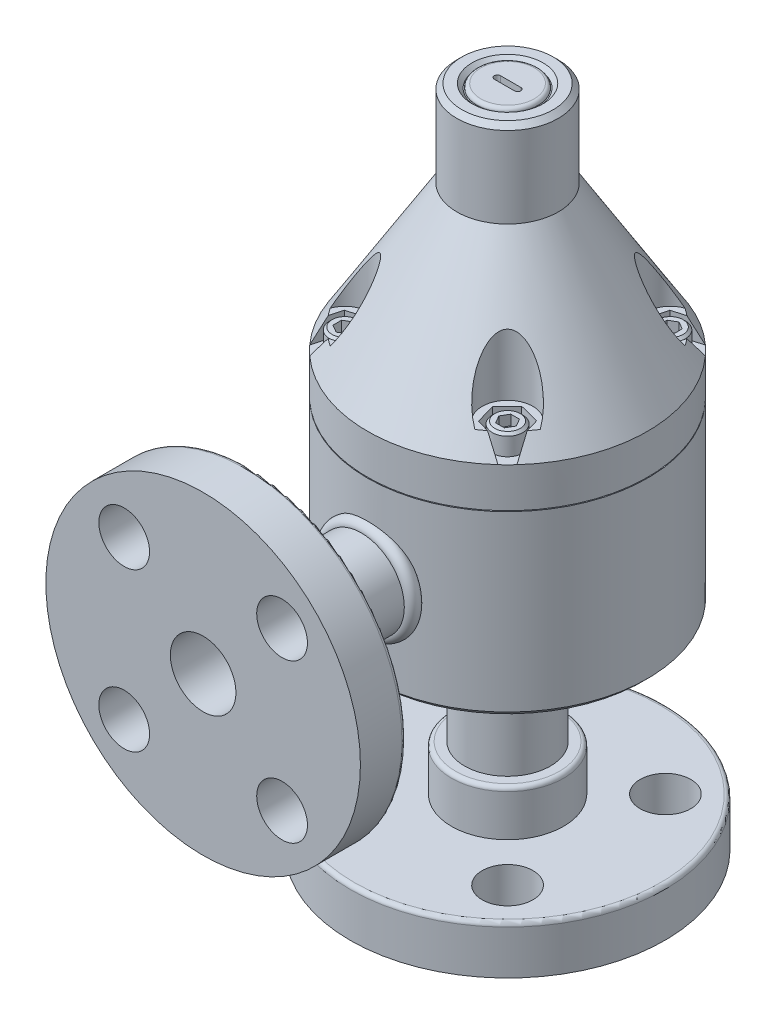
from build123d import *

# Parameters (mm, degrees)
SKETCH1_R                = 43.815
EXTRUDE1_DEPTH           = 140.97
SKETCH3_R                = 11.1125
EXTRUDE2_DEPTH           = 1.27
EXTRUDE2_DRAFT           = -45
CHAMFER1_SIZE            = 1.5748
SKETCH4_R                = 9.525
EXTRUDE3_DEPTH           = 1.27
FILLET1_R                = 1.143
EXTRUDE4_DEPTH           = 3.302
EXTRUDE4_DRAFT           = -1
SKETCH6_R                = 7.9375
EXTRUDE5_DEPTH           = 22.86
EXTRUDE6_DEPTH           = 6.35
CIRPATTERN1_COUNT        = 4
SKETCH9_R                = 4.7625
EXTRUDE7_DEPTH           = 6.35
EXTRUDE8_DEPTH           = 3.175
CIRPATTERN2_COUNT        = 4
CHAMFER2_SIZE            = 0.762
SKETCH11_R               = 49.2125
BOSS_EXTRUDE1_DEPTH      = 14.2748
SKETCH12_R               = 17.4625
BOSS_EXTRUDE2_DEPTH      = 26.2128
BOSS_EXTRUDE3_REACH      = 206.043
BOSS_EXTRUDE3_END_RADIUS = 43.815
SKETCH13_R               = 13.4366
SKETCH14_R               = 10.2616
CUT_EXTRUDE1_DEPTH       = 25.4
SKETCH15_R               = 7.9375
CUT_EXTRUDE2_DEPTH       = 25.4
CIRPATTERN3_COUNT        = 4
SKETCH23_R               = 49.2125
BOSS_EXTRUDE8_DEPTH      = 15.0622
SKETCH24_R               = 17.526
BOSS_EXTRUDE9_DEPTH      = 29.3624
SKETCH25_R               = 13.4366
BOSS_EXTRUDE10_DEPTH     = 66.675
SKETCH26_R               = 10.2616
CUT_EXTRUDE5_DEPTH       = 25.4
FILLET4_R                = 1.27
SKETCH27_R               = 7.9375
CUT_EXTRUDE6_DEPTH       = 25.4
CIRPATTERN5_COUNT        = 4
FILLET5_R                = 1.27


with BuildPart() as part:
    # Sketch1 → Extrude1 (new body)
    with BuildSketch(Plane(origin=(0, 0, 0), x_dir=(1, 0, 0), z_dir=(0, 1, 0))):
        with Locations(Location((0, 0, 0), (0, 0, 270))):
            Circle(SKETCH1_R)
    extrude(amount=EXTRUDE1_DEPTH)

    # Sketch2 → Cut-Revolve1 (revolve, cut)
    with BuildSketch(Plane.XY, mode=Mode.PRIVATE) as cut_revolve1_sk:
        Polygon((-43.815, 56.134), (-43.815, 68.58), (-15.875, 114.046), (-15.875, 147.034008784), (-49.44729897, 147.034008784), (-49.44729897, 55.88), (-30.226, 55.88), (-30.226, 56.134), align=None)
    revolve(cut_revolve1_sk.sketch.rotate(Axis((0, 0, 0), (0, 1, 0)), 270), axis=Axis((0, 0, 0), (0, 1, 0)), mode=Mode.SUBTRACT)


with BuildPart() as extrude2_tool:
    # Sketch3 → Extrude2 (with draft: the straight prism first)
    with BuildSketch(Plane(origin=(0, 140.97, 0), x_dir=(-1, 0, 0), z_dir=(0, 1, 0))):
        Circle(SKETCH3_R)
    extrude(amount=-EXTRUDE2_DEPTH)
    # Extrude2: the draft: its side faces are tilted about the plane it starts from
    extrude2_sides = [extrude2_tool.faces().sort_by_distance(p)[0] for p in [
        (11.1125, 140.335, 0),
    ]]
    draft(extrude2_sides, Plane(origin=(0, 140.97, 0), x_dir=(-1, 0, 0), z_dir=(0, 1, 0)), EXTRUDE2_DRAFT)


with BuildPart() as part_1:
    add(part.part)

    # Extrude2: cut by extrude2_tool
    add(extrude2_tool.part, mode=Mode.SUBTRACT)

    # Chamfer1
    chamfer1_edges = [part_1.edges().sort_by_distance(p)[0] for p in [
        (0, 0, -43.815),
        (0, 140.97, 15.875),
    ]]
    chamfer(chamfer1_edges, length=CHAMFER1_SIZE)

    # Sketch4 → Extrude3 (add)
    with BuildSketch(Plane(origin=(0, 140.97, 0), x_dir=(-1, 0, 0), z_dir=(0, 1, 0))):
        with Locations(Location((0, 0, 0), (0, 0, 90))):
            Circle(SKETCH4_R)
    extrude(amount=-EXTRUDE3_DEPTH)

    # Fillet1
    fillet1_edges = [part_1.edges().sort_by_distance(p)[0] for p in [
        (0, 140.97, -9.525),
    ]]
    fillet(fillet1_edges, radius=FILLET1_R)


with BuildPart() as extrude4_tool:
    # Sketch5 → Extrude4 (with draft: the straight prism first)
    with BuildSketch(Plane(origin=(0, 140.97, 0), x_dir=(-1, 0, 0), z_dir=(0, 1, 0))):
        with BuildLine():
            Line((3.175, 0.9652), (-3.175, 0.9652))
            ThreePointArc((-3.175, 0.9652), (-4.1402, 0), (-3.175, -0.9652))
            Line((-3.175, -0.9652), (3.175, -0.9652))
            ThreePointArc((3.175, -0.9652), (4.1402, 0), (3.175, 0.9652))
        make_face()
    extrude(amount=-EXTRUDE4_DEPTH)
    # Extrude4: the draft: its side faces are tilted about the plane it starts from
    extrude4_sides = [extrude4_tool.faces().sort_by_distance(p)[0] for p in [
        (-4.1402, 139.319, 0),
        (0, 139.319, 0.9652),
        (4.1402, 139.319, 0),
        (0, 139.319, -0.9652),
    ]]
    draft(extrude4_sides, Plane(origin=(0, 140.97, 0), x_dir=(-1, 0, 0), z_dir=(0, 1, 0)), EXTRUDE4_DRAFT)


with BuildPart() as part_2:
    add(part_1.part)

    # Extrude4: cut by extrude4_tool
    add(extrude4_tool.part, mode=Mode.SUBTRACT)

    # Sketch6 → Extrude5 (cut)
    with BuildSketch(Plane(origin=(0, 74.93, 0), x_dir=(-1, 0, 0), z_dir=(0, 1, 0))):
        with Locations((-25.459026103, 25.459026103)):
            Circle(SKETCH6_R)
    extrude5 = extrude(amount=EXTRUDE5_DEPTH, mode=Mode.SUBTRACT)

    # Sketch8 → Extrude6 (cut)
    with BuildSketch(Plane(origin=(0, 74.93, 0), x_dir=(-1, 0, 0), z_dir=(0, 1, 0))):
        Polygon((-29.948607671, 20.824591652), (-23.690278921, 19.253717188), (-19.200697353, 23.888151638), (-20.969444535, 30.093460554), (-33.591654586, 33.591654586), align=None)
    extrude6 = extrude(amount=-EXTRUDE6_DEPTH, mode=Mode.SUBTRACT)

    # CirPattern1: Extrude5, Extrude6 ×4 about axis
    cirpattern1_axis = Axis((0, 0, 0), (0, 1, 0))
    add([extrude5.rotate(cirpattern1_axis, i * 360 / CIRPATTERN1_COUNT) for i in range(1, CIRPATTERN1_COUNT)], mode=Mode.SUBTRACT)
    add([extrude6.rotate(cirpattern1_axis, i * 360 / CIRPATTERN1_COUNT) for i in range(1, CIRPATTERN1_COUNT)], mode=Mode.SUBTRACT)

    # Sketch9 → Extrude7 (add)
    with BuildSketch(Plane(origin=(0, 74.93, 0), x_dir=(-1, 0, 0), z_dir=(0, 1, 0))):
        with Locations(Location((-25.459026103, 25.459026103, 0), (0, 0, 90))):
            Circle(SKETCH9_R)
    extrude7 = extrude(amount=-EXTRUDE7_DEPTH)

    # Sketch10 → Extrude8 (cut)
    with BuildSketch(Plane(origin=(0, 74.93, 0), x_dir=(-1, 0, 0), z_dir=(0, 1, 0))):
        Polygon((-28.187127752, 25.459026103), (-26.823076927, 23.096420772), (-24.094975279, 23.096420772), (-22.730924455, 25.459026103), (-24.094975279, 27.821631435), (-26.823076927, 27.821631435), align=None)
    extrude8 = extrude(amount=-EXTRUDE8_DEPTH, mode=Mode.SUBTRACT)

    # CirPattern2: Extrude7, Extrude8 ×4 about axis
    cirpattern2_axis = Axis((0, 0, 0), (0, 1, 0))
    add([extrude7.rotate(cirpattern2_axis, i * 360 / CIRPATTERN2_COUNT) for i in range(1, CIRPATTERN2_COUNT)])
    add([extrude8.rotate(cirpattern2_axis, i * 360 / CIRPATTERN2_COUNT) for i in range(1, CIRPATTERN2_COUNT)], mode=Mode.SUBTRACT)

    # Chamfer2
    chamfer2_edges = [part_2.edges().sort_by_distance(p)[0] for p in [
        (25.459026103, 74.93, 20.696526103),
        (-20.696526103, 74.93, 25.459026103),
        (-25.459026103, 74.93, -20.696526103),
        (20.696526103, 74.93, -25.459026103),
    ]]
    chamfer(chamfer2_edges, length=CHAMFER2_SIZE)



with BuildPart() as body_2:
    # Sketch11 → Boss-Extrude1 (new body)
    with BuildSketch(Plane.XY.offset(95.25)):
        with Locations((0, 28.575)):
            Circle(SKETCH11_R)
    extrude(amount=-BOSS_EXTRUDE1_DEPTH)

    # Sketch12 → Boss-Extrude2 (add)
    with BuildSketch(Plane.XY.offset(95.25)):
        with Locations((0, 28.575)):
            Circle(SKETCH12_R)
    extrude(amount=-BOSS_EXTRUDE2_DEPTH)


with BuildPart() as part_3:
    add(part_2.part)

    add(body_2.part)  # Boss-Extrude3 merges body 2
    # Boss-Extrude3: up to this cylinder (the profile starts outside it)
    boss_extrude3_end = Plane(origin=(0, 28.575, 0), z_dir=(0, -1, 0)) * Cylinder(BOSS_EXTRUDE3_END_RADIUS, 500.716, mode=Mode.PRIVATE)
    # Sketch13 → Boss-Extrude3 (add, up to the surface)
    with BuildSketch(Plane.XY.offset(95.25), mode=Mode.PRIVATE) as boss_extrude3_sk1:
        with Locations((0, 28.575)):
            Circle(SKETCH13_R)
    boss_extrude3_tool1 = extrude(boss_extrude3_sk1.sketch, amount=-BOSS_EXTRUDE3_REACH, mode=Mode.PRIVATE) - boss_extrude3_end
    add(boss_extrude3_tool1.solids().sort_by_distance((0, 28.575, 95.25))[0])

    # Sketch14 → Cut-Extrude1 (cut)
    with BuildSketch(Plane.XY.offset(95.25)):
        with Locations((0, 28.575)):
            Circle(SKETCH14_R)
    extrude(amount=-CUT_EXTRUDE1_DEPTH, mode=Mode.SUBTRACT)

    # Sketch15 → Cut-Extrude2 (cut)
    with BuildSketch(Plane.XY.offset(95.25)):
        with Locations((-24.695704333, 53.270704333)):
            Circle(SKETCH15_R)
    cut_extrude2 = extrude(amount=-CUT_EXTRUDE2_DEPTH, mode=Mode.SUBTRACT)

    # CirPattern3: Cut-Extrude2 ×4 about axis
    cirpattern3_axis = Axis((0, 28.575, 0), (0, 0, 1))
    for i in range(1, CIRPATTERN3_COUNT):
        add(cut_extrude2.rotate(cirpattern3_axis, i * 360 / CIRPATTERN3_COUNT), mode=Mode.SUBTRACT)

    # Sketch16 → Revolve1 (revolve)
    with BuildSketch(Plane(origin=(0, 0, 0), x_dir=(0, 0, -1), z_dir=(1, 0, 0)), mode=Mode.PRIVATE) as revolve1_sk:
        with BuildLine():
            Line((-41.255708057, 38.10228525), (-45.737066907, 38.10228525))
            Line((-45.737066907, 38.10228525), (-45.737066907, 42.0116))
            ThreePointArc((-45.737066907, 42.0116), (-43.699332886, 44.263475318), (-41.255708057, 42.460145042))
            Line((-41.255708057, 42.460145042), (-41.255708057, 38.10228525))
        make_face()
    revolve(revolve1_sk.sketch.rotate(Axis((0, 28.575, 95.25), (0, 0, -1)), 90), axis=Axis((0, 28.575, 95.25), (0, 0, -1)))

    # Fillet5
    fillet5_edges = [part_3.edges().sort_by_distance(p)[0] for p in [
        (-49.2125, 28.575, 80.9752),
        (-17.4625, 28.575, 69.0372),
    ]]
    fillet(fillet5_edges, radius=FILLET5_R)



with BuildPart() as body_2_2:
    # Sketch23 → Boss-Extrude8 (new body)
    with BuildSketch(Plane(origin=(0, -66.675, 0), x_dir=(1, 0, 0), z_dir=(0, 1, 0))):
        with Locations(Location((0, 0, 0), (0, 0, 270))):
            Circle(SKETCH23_R)
    extrude(amount=BOSS_EXTRUDE8_DEPTH)

    # Sketch24 → Boss-Extrude9 (add)
    with BuildSketch(Plane(origin=(0, -66.675, 0), x_dir=(1, 0, 0), z_dir=(0, 1, 0))):
        with Locations(Location((0, 0, 0), (0, 0, 270))):
            Circle(SKETCH24_R)
    extrude(amount=BOSS_EXTRUDE9_DEPTH)

    # Sketch25 → Boss-Extrude10 (add)
    with BuildSketch(Plane(origin=(0, -66.675, 0), x_dir=(1, 0, 0), z_dir=(0, 1, 0))):
        with Locations(Location((0, 0, 0), (0, 0, 90))):
            Circle(SKETCH25_R)
    extrude(amount=BOSS_EXTRUDE10_DEPTH)

    # Sketch26 → Cut-Extrude5 (cut)
    with BuildSketch(Plane(origin=(0, -66.675, 0), x_dir=(1, 0, 0), z_dir=(0, 1, 0))):
        with Locations(Location((0, 0, 0), (0, 0, 270))):
            Circle(SKETCH26_R)
    extrude(amount=CUT_EXTRUDE5_DEPTH, mode=Mode.SUBTRACT)

    # Fillet4
    fillet4_edges = [body_2_2.edges().sort_by_distance(p)[0] for p in [
        (0, -51.6128, -49.2125),
        (0, -37.3126, -17.526),
    ]]
    fillet(fillet4_edges, radius=FILLET4_R)

    # Sketch27 → Cut-Extrude6 (cut)
    with BuildSketch(Plane(origin=(0, -66.675, 0), x_dir=(1, 0, 0), z_dir=(0, 1, 0))):
        with Locations(Location((-24.695704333, -24.695704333, 0), (0, 0, 270))):
            Circle(SKETCH27_R)
    cut_extrude6 = extrude(amount=CUT_EXTRUDE6_DEPTH, mode=Mode.SUBTRACT)

    # CirPattern5: Cut-Extrude6 ×4 about axis
    cirpattern5_axis = Axis((0, 0, 0), (0, 1, 0))
    for i in range(1, CIRPATTERN5_COUNT):
        add(cut_extrude6.rotate(cirpattern5_axis, i * 360 / CIRPATTERN5_COUNT), mode=Mode.SUBTRACT)


with BuildPart() as part_4:
    add(part_3.part)

    add(body_2_2.part)  # Revolve2 merges body 2 2
    # Sketch28 → Revolve2 (revolve)
    with BuildSketch(Plane(origin=(0, 0, 0), x_dir=(0, 0, -1), z_dir=(1, 0, 0))):
        with BuildLine():
            Line((-16.6116, 0.457946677), (-16.6116, 2.030776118))
            Line((-16.6116, 2.030776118), (-12.912020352, 2.030776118))
            Line((-12.912020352, 2.030776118), (-12.912020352, -3.175))
            ThreePointArc((-12.912020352, -3.175), (-15.715319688, -2.329524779), (-16.6116, 0.457946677))
        make_face()
    revolve(axis=Axis((0, 0, 0), (0, -1, 0)))


solid = part_4.part
